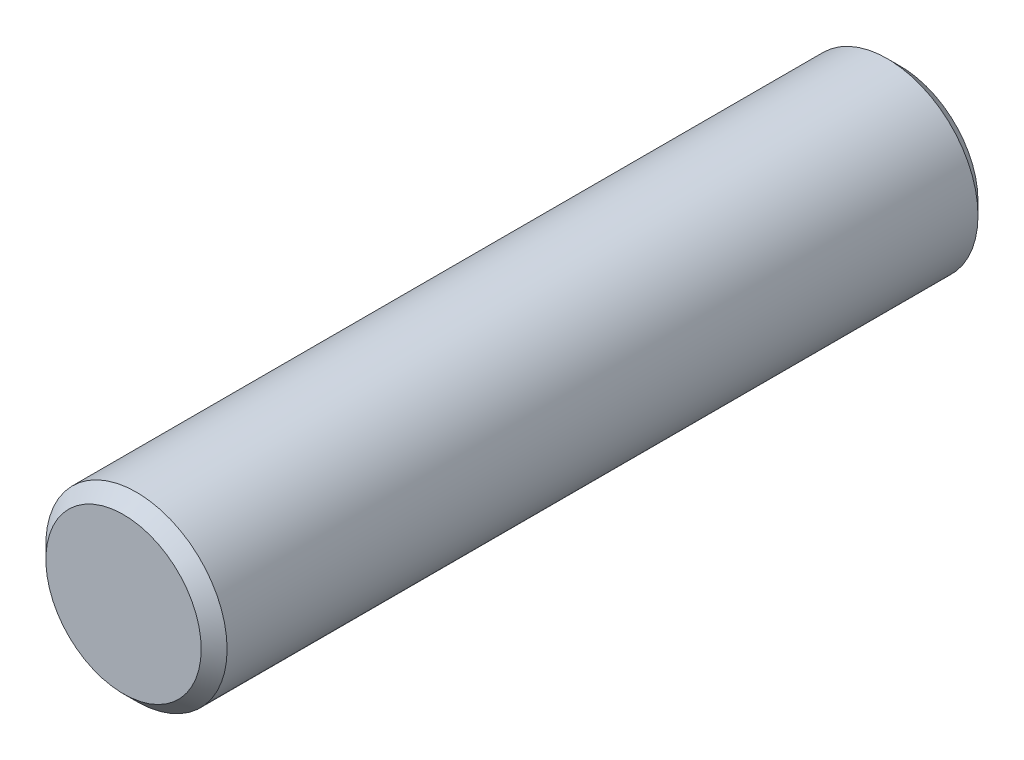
from build123d import *

# Parameters (mm, degrees)
ESQUISSE1_R          = 3.5
BASE_EXTRUSION_DEPTH = 30
CHANFREIN1_SIZE      = 0.5


with BuildPart() as part:
    # Esquisse1 → Base-Extrusion (new body)
    with BuildSketch(Plane.XY):
        Circle(ESQUISSE1_R)
    extrude(amount=BASE_EXTRUSION_DEPTH)

    # Chanfrein1
    chanfrein1_edges = [part.edges().sort_by_distance(p)[0] for p in [
        (-3.5, 0, 0),
        (-3.5, 0, 30),
    ]]
    chamfer(chanfrein1_edges, length=CHANFREIN1_SIZE)


solid = part.part
